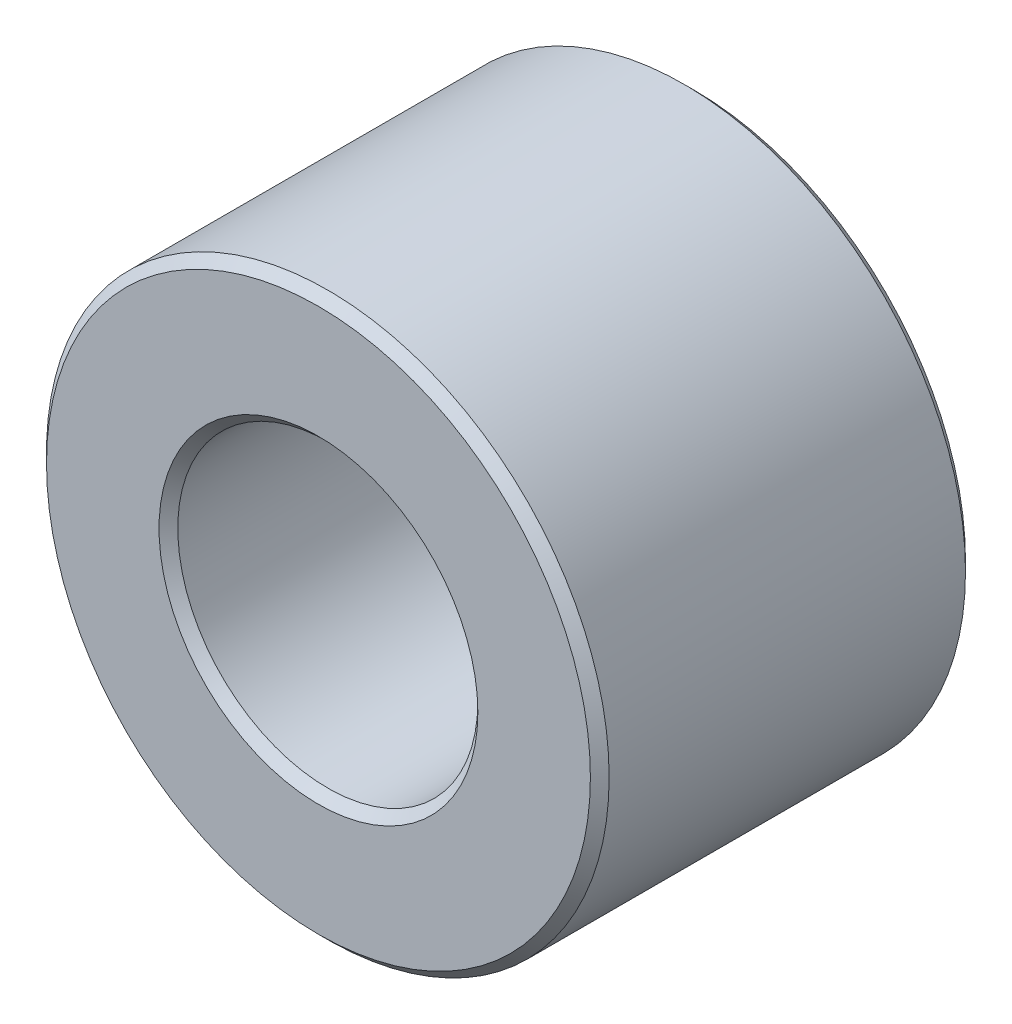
ISO-10303-21;
HEADER;
FILE_DESCRIPTION(('STEP AP214'),'2;1');
FILE_NAME('part.step','',(''),(''),'','','');
FILE_SCHEMA(('AUTOMOTIVE_DESIGN { 1 0 10303 214 1 1 1 1 }'));
ENDSEC;
DATA;
#1=APPLICATION_CONTEXT('core data for automotive mechanical design processes');
#2=APPLICATION_PROTOCOL_DEFINITION('international standard','automotive_design',2000,#1);
#3=PRODUCT_CONTEXT('',#1,'mechanical');
#4=PRODUCT('Part','Part','',(#3));
#5=PRODUCT_RELATED_PRODUCT_CATEGORY('part','',(#4));
#6=PRODUCT_DEFINITION_FORMATION('','',#4);
#7=PRODUCT_DEFINITION_CONTEXT('part definition',#1,'design');
#8=PRODUCT_DEFINITION('design','',#6,#7);
#9=PRODUCT_DEFINITION_SHAPE('','',#8);
#10=(LENGTH_UNIT() NAMED_UNIT(*) SI_UNIT(.MILLI.,.METRE.));
#11=(NAMED_UNIT(*) PLANE_ANGLE_UNIT() SI_UNIT($,.RADIAN.));
#12=(NAMED_UNIT(*) SI_UNIT($,.STERADIAN.) SOLID_ANGLE_UNIT());
#13=UNCERTAINTY_MEASURE_WITH_UNIT(LENGTH_MEASURE(1.E-05),#10,'distance_accuracy_value','');
#14=(GEOMETRIC_REPRESENTATION_CONTEXT(3) GLOBAL_UNCERTAINTY_ASSIGNED_CONTEXT((#13)) GLOBAL_UNIT_ASSIGNED_CONTEXT((#10,
#11,#12)) REPRESENTATION_CONTEXT('',''));
#15=CARTESIAN_POINT('',(0.,0.,0.));
#16=DIRECTION('',(0.,0.,1.));
#17=DIRECTION('',(1.,0.,0.));
#18=AXIS2_PLACEMENT_3D('',#15,#16,#17);
#19=CARTESIAN_POINT('',(0.,0.,2.));
#20=DIRECTION('',(0.,0.,1.));
#21=DIRECTION('',(1.,0.,0.));
#22=AXIS2_PLACEMENT_3D('',#19,#20,#21);
#23=PLANE('',#22);
#24=CARTESIAN_POINT('',(0.,0.,2.));
#25=DIRECTION('',(0.,0.,1.));
#26=DIRECTION('',(1.,0.,0.));
#27=AXIS2_PLACEMENT_3D('',#24,#25,#26);
#28=CIRCLE('',#27,1.7);
#29=CARTESIAN_POINT('',(1.7,0.,2.));
#30=VERTEX_POINT('',#29);
#31=EDGE_CURVE('E10',#30,#30,#28,.F.);
#32=ORIENTED_EDGE('',*,*,#31,.T.);
#33=EDGE_LOOP('',(#32));
#34=FACE_BOUND('',#33,.T.);
#35=CARTESIAN_POINT('',(0.,0.,2.));
#36=DIRECTION('',(0.,0.,1.));
#37=DIRECTION('',(1.,0.,0.));
#38=AXIS2_PLACEMENT_3D('',#35,#36,#37);
#39=CIRCLE('',#38,2.9);
#40=CARTESIAN_POINT('',(2.9,0.,2.));
#41=VERTEX_POINT('',#40);
#42=EDGE_CURVE('E45',#41,#41,#39,.T.);
#43=ORIENTED_EDGE('',*,*,#42,.T.);
#44=EDGE_LOOP('',(#43));
#45=FACE_BOUND('',#44,.T.);
#46=ADVANCED_FACE('F37',(#34,#45),#23,.T.);
#47=CARTESIAN_POINT('',(0.,0.,-2.));
#48=DIRECTION('',(0.,0.,1.));
#49=DIRECTION('',(1.,0.,0.));
#50=AXIS2_PLACEMENT_3D('',#47,#48,#49);
#51=PLANE('',#50);
#52=CARTESIAN_POINT('',(0.,0.,-2.));
#53=DIRECTION('',(0.,0.,1.));
#54=DIRECTION('',(1.,0.,0.));
#55=AXIS2_PLACEMENT_3D('',#52,#53,#54);
#56=CIRCLE('',#55,2.9);
#57=CARTESIAN_POINT('',(2.9,0.,-2.));
#58=VERTEX_POINT('',#57);
#59=EDGE_CURVE('E63',#58,#58,#56,.F.);
#60=ORIENTED_EDGE('',*,*,#59,.T.);
#61=EDGE_LOOP('',(#60));
#62=FACE_BOUND('',#61,.T.);
#63=CARTESIAN_POINT('',(0.,0.,-2.));
#64=DIRECTION('',(0.,0.,1.));
#65=DIRECTION('',(1.,0.,0.));
#66=AXIS2_PLACEMENT_3D('',#63,#64,#65);
#67=CIRCLE('',#66,1.7);
#68=CARTESIAN_POINT('',(1.7,0.,-2.));
#69=VERTEX_POINT('',#68);
#70=EDGE_CURVE('E67',#69,#69,#67,.T.);
#71=ORIENTED_EDGE('',*,*,#70,.T.);
#72=EDGE_LOOP('',(#71));
#73=FACE_BOUND('',#72,.T.);
#74=ADVANCED_FACE('F89',(#62,#73),#51,.F.);
#75=CARTESIAN_POINT('',(0.,0.,2.));
#76=DIRECTION('',(0.,0.,-1.));
#77=DIRECTION('',(-1.,0.,0.));
#78=AXIS2_PLACEMENT_3D('',#75,#76,#77);
#79=CYLINDRICAL_SURFACE('',#78,3.);
#80=CARTESIAN_POINT('',(0.,0.,-1.9));
#81=DIRECTION('',(0.,0.,1.));
#82=DIRECTION('',(1.,0.,0.));
#83=AXIS2_PLACEMENT_3D('',#80,#81,#82);
#84=CIRCLE('',#83,3.);
#85=CARTESIAN_POINT('',(3.,0.,-1.9));
#86=VERTEX_POINT('',#85);
#87=EDGE_CURVE('E70',#86,#86,#84,.T.);
#88=ORIENTED_EDGE('',*,*,#87,.T.);
#89=EDGE_LOOP('',(#88));
#90=FACE_BOUND('',#89,.T.);
#91=CARTESIAN_POINT('',(0.,0.,1.9));
#92=DIRECTION('',(0.,0.,1.));
#93=DIRECTION('',(1.,0.,0.));
#94=AXIS2_PLACEMENT_3D('',#91,#92,#93);
#95=CIRCLE('',#94,3.);
#96=CARTESIAN_POINT('',(3.,0.,1.9));
#97=VERTEX_POINT('',#96);
#98=EDGE_CURVE('E74',#97,#97,#95,.F.);
#99=ORIENTED_EDGE('',*,*,#98,.T.);
#100=EDGE_LOOP('',(#99));
#101=FACE_BOUND('',#100,.T.);
#102=ADVANCED_FACE('F78',(#90,#101),#79,.T.);
#103=CARTESIAN_POINT('',(0.,0.,2.));
#104=DIRECTION('',(0.,0.,-1.));
#105=DIRECTION('',(-1.,0.,0.));
#106=AXIS2_PLACEMENT_3D('',#103,#104,#105);
#107=CYLINDRICAL_SURFACE('',#106,1.6);
#108=CARTESIAN_POINT('',(0.,0.,-1.9));
#109=DIRECTION('',(0.,0.,1.));
#110=DIRECTION('',(1.,0.,0.));
#111=AXIS2_PLACEMENT_3D('',#108,#109,#110);
#112=CIRCLE('',#111,1.6);
#113=CARTESIAN_POINT('',(1.6,0.,-1.9));
#114=VERTEX_POINT('',#113);
#115=EDGE_CURVE('E52',#114,#114,#112,.F.);
#116=ORIENTED_EDGE('',*,*,#115,.T.);
#117=EDGE_LOOP('',(#116));
#118=FACE_BOUND('',#117,.T.);
#119=CARTESIAN_POINT('',(0.,0.,1.9));
#120=DIRECTION('',(0.,0.,1.));
#121=DIRECTION('',(1.,0.,0.));
#122=AXIS2_PLACEMENT_3D('',#119,#120,#121);
#123=CIRCLE('',#122,1.6);
#124=CARTESIAN_POINT('',(1.6,0.,1.9));
#125=VERTEX_POINT('',#124);
#126=EDGE_CURVE('E58',#125,#125,#123,.T.);
#127=ORIENTED_EDGE('',*,*,#126,.T.);
#128=EDGE_LOOP('',(#127));
#129=FACE_BOUND('',#128,.T.);
#130=ADVANCED_FACE('F97',(#118,#129),#107,.F.);
#131=CARTESIAN_POINT('',(0.,0.,-1.9));
#132=DIRECTION('',(0.,0.,1.));
#133=DIRECTION('',(1.,0.,0.));
#134=AXIS2_PLACEMENT_3D('',#131,#132,#133);
#135=CONICAL_SURFACE('',#134,3.,0.78539816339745);
#136=ORIENTED_EDGE('',*,*,#59,.F.);
#137=EDGE_LOOP('',(#136));
#138=FACE_BOUND('',#137,.T.);
#139=ORIENTED_EDGE('',*,*,#87,.F.);
#140=EDGE_LOOP('',(#139));
#141=FACE_BOUND('',#140,.T.);
#142=ADVANCED_FACE('F102',(#138,#141),#135,.T.);
#143=CARTESIAN_POINT('',(0.,0.,-2.));
#144=DIRECTION('',(0.,0.,-1.));
#145=DIRECTION('',(-1.,0.,0.));
#146=AXIS2_PLACEMENT_3D('',#143,#144,#145);
#147=CONICAL_SURFACE('',#146,1.7,0.785398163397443);
#148=ORIENTED_EDGE('',*,*,#115,.F.);
#149=EDGE_LOOP('',(#148));
#150=FACE_BOUND('',#149,.T.);
#151=ORIENTED_EDGE('',*,*,#70,.F.);
#152=EDGE_LOOP('',(#151));
#153=FACE_BOUND('',#152,.T.);
#154=ADVANCED_FACE('F86',(#150,#153),#147,.F.);
#155=CARTESIAN_POINT('',(0.,0.,1.9));
#156=DIRECTION('',(0.,0.,1.));
#157=DIRECTION('',(1.,0.,0.));
#158=AXIS2_PLACEMENT_3D('',#155,#156,#157);
#159=CONICAL_SURFACE('',#158,1.6,0.785398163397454);
#160=ORIENTED_EDGE('',*,*,#31,.F.);
#161=EDGE_LOOP('',(#160));
#162=FACE_BOUND('',#161,.T.);
#163=ORIENTED_EDGE('',*,*,#126,.F.);
#164=EDGE_LOOP('',(#163));
#165=FACE_BOUND('',#164,.T.);
#166=ADVANCED_FACE('F82',(#162,#165),#159,.F.);
#167=CARTESIAN_POINT('',(0.,0.,2.));
#168=DIRECTION('',(0.,0.,-1.));
#169=DIRECTION('',(-1.,0.,0.));
#170=AXIS2_PLACEMENT_3D('',#167,#168,#169);
#171=CONICAL_SURFACE('',#170,2.9,0.785398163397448);
#172=ORIENTED_EDGE('',*,*,#98,.F.);
#173=EDGE_LOOP('',(#172));
#174=FACE_BOUND('',#173,.T.);
#175=ORIENTED_EDGE('',*,*,#42,.F.);
#176=EDGE_LOOP('',(#175));
#177=FACE_BOUND('',#176,.T.);
#178=ADVANCED_FACE('F39',(#174,#177),#171,.T.);
#179=CLOSED_SHELL('',(#46,#74,#102,#130,#142,#154,#166,#178));
#180=MANIFOLD_SOLID_BREP('B2',#179);
#181=ADVANCED_BREP_SHAPE_REPRESENTATION('',(#18,#180),#14);
#182=SHAPE_DEFINITION_REPRESENTATION(#9,#181);
ENDSEC;
END-ISO-10303-21;
